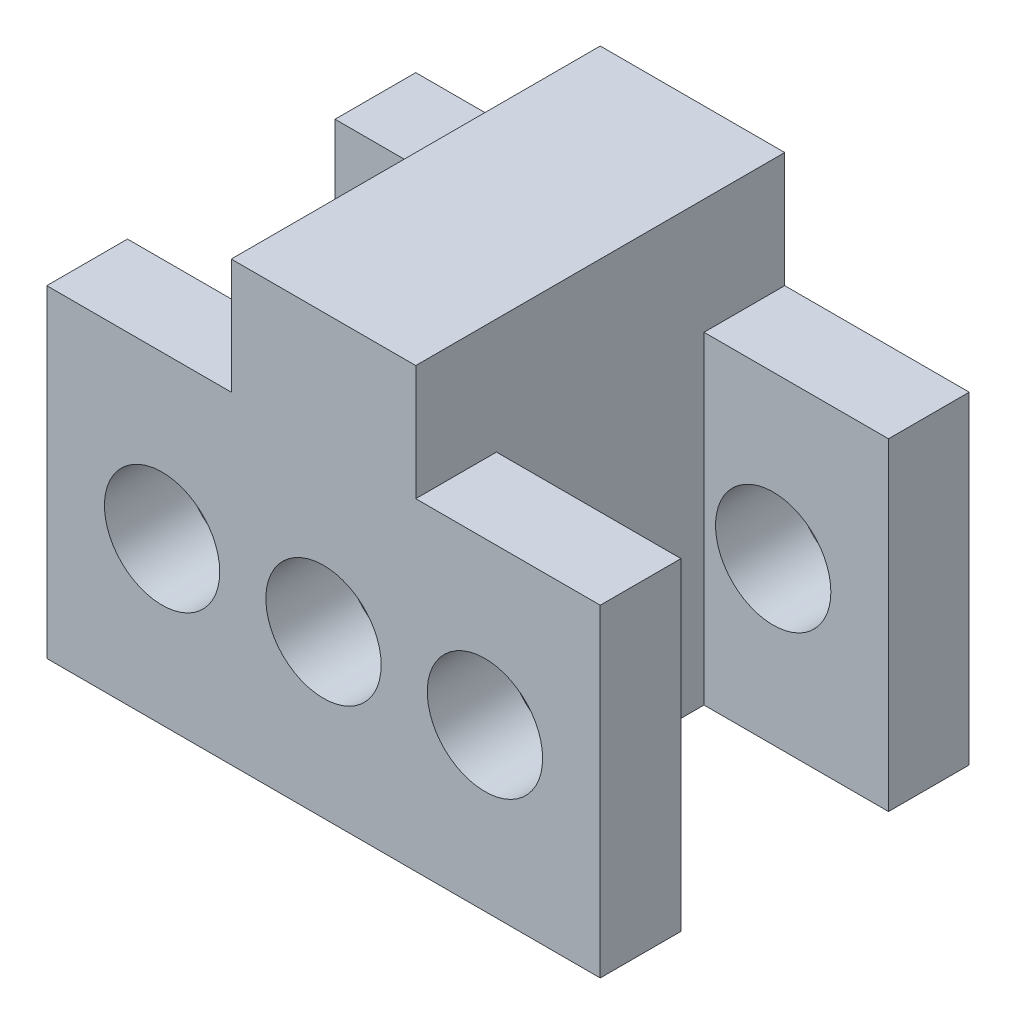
ISO-10303-21;
HEADER;
FILE_DESCRIPTION(('STEP AP214'),'2;1');
FILE_NAME('part.step','',(''),(''),'','','');
FILE_SCHEMA(('AUTOMOTIVE_DESIGN { 1 0 10303 214 1 1 1 1 }'));
ENDSEC;
DATA;
#1=APPLICATION_CONTEXT('core data for automotive mechanical design processes');
#2=APPLICATION_PROTOCOL_DEFINITION('international standard','automotive_design',2000,#1);
#3=PRODUCT_CONTEXT('',#1,'mechanical');
#4=PRODUCT('Part','Part','',(#3));
#5=PRODUCT_RELATED_PRODUCT_CATEGORY('part','',(#4));
#6=PRODUCT_DEFINITION_FORMATION('','',#4);
#7=PRODUCT_DEFINITION_CONTEXT('part definition',#1,'design');
#8=PRODUCT_DEFINITION('design','',#6,#7);
#9=PRODUCT_DEFINITION_SHAPE('','',#8);
#10=(LENGTH_UNIT() NAMED_UNIT(*) SI_UNIT(.MILLI.,.METRE.));
#11=(NAMED_UNIT(*) PLANE_ANGLE_UNIT() SI_UNIT($,.RADIAN.));
#12=(NAMED_UNIT(*) SI_UNIT($,.STERADIAN.) SOLID_ANGLE_UNIT());
#13=UNCERTAINTY_MEASURE_WITH_UNIT(LENGTH_MEASURE(1.E-05),#10,'distance_accuracy_value','');
#14=(GEOMETRIC_REPRESENTATION_CONTEXT(3) GLOBAL_UNCERTAINTY_ASSIGNED_CONTEXT((#13)) GLOBAL_UNIT_ASSIGNED_CONTEXT((#10,
#11,#12)) REPRESENTATION_CONTEXT('',''));
#15=CARTESIAN_POINT('',(0.,0.,0.));
#16=DIRECTION('',(0.,0.,1.));
#17=DIRECTION('',(1.,0.,0.));
#18=AXIS2_PLACEMENT_3D('',#15,#16,#17);
#19=CARTESIAN_POINT('',(-48.,-28.,18.));
#20=DIRECTION('',(0.,0.,1.));
#21=DIRECTION('',(1.,0.,0.));
#22=AXIS2_PLACEMENT_3D('',#19,#20,#21);
#23=PLANE('',#22);
#24=CARTESIAN_POINT('',(28.,0.,18.));
#25=DIRECTION('',(0.,0.,1.));
#26=DIRECTION('',(1.,0.,0.));
#27=AXIS2_PLACEMENT_3D('',#24,#25,#26);
#28=CIRCLE('',#27,10.);
#29=CARTESIAN_POINT('',(38.,0.,18.));
#30=VERTEX_POINT('',#29);
#31=EDGE_CURVE('E234',#30,#30,#28,.T.);
#32=ORIENTED_EDGE('',*,*,#31,.T.);
#33=EDGE_LOOP('',(#32));
#34=FACE_BOUND('',#33,.T.);
#35=DIRECTION('',(1.,0.,0.));
#36=VECTOR('',#35,1.);
#37=CARTESIAN_POINT('',(-48.,-28.,18.));
#38=LINE('',#37,#36);
#39=CARTESIAN_POINT('',(16.,-28.,18.));
#40=VERTEX_POINT('',#39);
#41=CARTESIAN_POINT('',(48.,-28.,18.));
#42=VERTEX_POINT('',#41);
#43=EDGE_CURVE('E49',#40,#42,#38,.T.);
#44=ORIENTED_EDGE('',*,*,#43,.F.);
#45=DIRECTION('',(0.,-1.,0.));
#46=VECTOR('',#45,1.);
#47=CARTESIAN_POINT('',(15.9999999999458,500000.,18.));
#48=LINE('',#47,#46);
#49=CARTESIAN_POINT('',(16.,28.,18.));
#50=VERTEX_POINT('',#49);
#51=EDGE_CURVE('E170',#50,#40,#48,.T.);
#52=ORIENTED_EDGE('',*,*,#51,.F.);
#53=DIRECTION('',(-1.,0.,0.));
#54=VECTOR('',#53,1.);
#55=CARTESIAN_POINT('',(-48.,28.,18.));
#56=LINE('',#55,#54);
#57=CARTESIAN_POINT('',(48.,28.,18.));
#58=VERTEX_POINT('',#57);
#59=EDGE_CURVE('E262',#58,#50,#56,.T.);
#60=ORIENTED_EDGE('',*,*,#59,.F.);
#61=DIRECTION('',(0.,1.,0.));
#62=VECTOR('',#61,1.);
#63=CARTESIAN_POINT('',(48.,28.,18.));
#64=LINE('',#63,#62);
#65=EDGE_CURVE('E258',#42,#58,#64,.T.);
#66=ORIENTED_EDGE('',*,*,#65,.F.);
#67=EDGE_LOOP('',(#44,#52,#60,#66));
#68=FACE_BOUND('',#67,.T.);
#69=ADVANCED_FACE('F31',(#34,#68),#23,.F.);
#70=CARTESIAN_POINT('',(-48.,-28.,-18.));
#71=DIRECTION('',(0.,0.,-1.));
#72=DIRECTION('',(1.,0.,0.));
#73=AXIS2_PLACEMENT_3D('',#70,#71,#72);
#74=PLANE('',#73);
#75=CARTESIAN_POINT('',(28.,0.,-18.));
#76=DIRECTION('',(0.,0.,1.));
#77=DIRECTION('',(1.,0.,0.));
#78=AXIS2_PLACEMENT_3D('',#75,#76,#77);
#79=CIRCLE('',#78,10.);
#80=CARTESIAN_POINT('',(38.,0.,-18.));
#81=VERTEX_POINT('',#80);
#82=EDGE_CURVE('E187',#81,#81,#79,.T.);
#83=ORIENTED_EDGE('',*,*,#82,.F.);
#84=EDGE_LOOP('',(#83));
#85=FACE_BOUND('',#84,.T.);
#86=DIRECTION('',(-1.,0.,0.));
#87=VECTOR('',#86,1.);
#88=CARTESIAN_POINT('',(-48.,28.,-18.));
#89=LINE('',#88,#87);
#90=CARTESIAN_POINT('',(48.,28.,-18.));
#91=VERTEX_POINT('',#90);
#92=CARTESIAN_POINT('',(16.,28.,-18.));
#93=VERTEX_POINT('',#92);
#94=EDGE_CURVE('E166',#91,#93,#89,.T.);
#95=ORIENTED_EDGE('',*,*,#94,.T.);
#96=DIRECTION('',(0.,-1.,0.));
#97=VECTOR('',#96,1.);
#98=CARTESIAN_POINT('',(15.9999999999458,500000.,-18.));
#99=LINE('',#98,#97);
#100=CARTESIAN_POINT('',(16.,-28.,-18.));
#101=VERTEX_POINT('',#100);
#102=EDGE_CURVE('E163',#93,#101,#99,.T.);
#103=ORIENTED_EDGE('',*,*,#102,.T.);
#104=DIRECTION('',(1.,0.,0.));
#105=VECTOR('',#104,1.);
#106=CARTESIAN_POINT('',(-48.,-28.,-18.));
#107=LINE('',#106,#105);
#108=CARTESIAN_POINT('',(48.,-28.,-18.));
#109=VERTEX_POINT('',#108);
#110=EDGE_CURVE('E148',#101,#109,#107,.T.);
#111=ORIENTED_EDGE('',*,*,#110,.T.);
#112=DIRECTION('',(0.,1.,0.));
#113=VECTOR('',#112,1.);
#114=CARTESIAN_POINT('',(48.,28.,-18.));
#115=LINE('',#114,#113);
#116=EDGE_CURVE('E159',#109,#91,#115,.T.);
#117=ORIENTED_EDGE('',*,*,#116,.T.);
#118=EDGE_LOOP('',(#95,#103,#111,#117));
#119=FACE_BOUND('',#118,.T.);
#120=ADVANCED_FACE('F164',(#85,#119),#74,.F.);
#121=CARTESIAN_POINT('',(16.,28.,32.));
#122=DIRECTION('',(-1.,0.,0.));
#123=DIRECTION('',(0.,-1.,0.));
#124=AXIS2_PLACEMENT_3D('',#121,#122,#123);
#125=PLANE('',#124);
#126=DIRECTION('',(0.,1.,0.));
#127=VECTOR('',#126,1.);
#128=CARTESIAN_POINT('',(16.,28.,-32.));
#129=LINE('',#128,#127);
#130=CARTESIAN_POINT('',(16.,28.,-32.));
#131=VERTEX_POINT('',#130);
#132=CARTESIAN_POINT('',(16.,48.,-32.));
#133=VERTEX_POINT('',#132);
#134=EDGE_CURVE('E291',#131,#133,#129,.T.);
#135=ORIENTED_EDGE('',*,*,#134,.T.);
#136=DIRECTION('',(0.,0.,-1.));
#137=VECTOR('',#136,1.);
#138=CARTESIAN_POINT('',(16.,48.,32.));
#139=LINE('',#138,#137);
#140=CARTESIAN_POINT('',(16.,48.,32.));
#141=VERTEX_POINT('',#140);
#142=EDGE_CURVE('E11',#141,#133,#139,.T.);
#143=ORIENTED_EDGE('',*,*,#142,.F.);
#144=DIRECTION('',(0.,1.,0.));
#145=VECTOR('',#144,1.);
#146=CARTESIAN_POINT('',(16.,28.,32.));
#147=LINE('',#146,#145);
#148=CARTESIAN_POINT('',(16.,28.,32.));
#149=VERTEX_POINT('',#148);
#150=EDGE_CURVE('E303',#149,#141,#147,.T.);
#151=ORIENTED_EDGE('',*,*,#150,.F.);
#152=DIRECTION('',(0.,0.,-1.));
#153=VECTOR('',#152,1.);
#154=CARTESIAN_POINT('',(16.,28.,32.));
#155=LINE('',#154,#153);
#156=EDGE_CURVE('E308',#149,#50,#155,.T.);
#157=ORIENTED_EDGE('',*,*,#156,.T.);
#158=ORIENTED_EDGE('',*,*,#51,.T.);
#159=DIRECTION('',(0.,0.,1.));
#160=VECTOR('',#159,1.);
#161=CARTESIAN_POINT('',(16.,-28.,18.));
#162=LINE('',#161,#160);
#163=EDGE_CURVE('E153',#101,#40,#162,.T.);
#164=ORIENTED_EDGE('',*,*,#163,.F.);
#165=ORIENTED_EDGE('',*,*,#102,.F.);
#166=DIRECTION('',(0.,0.,1.));
#167=VECTOR('',#166,1.);
#168=CARTESIAN_POINT('',(16.,28.,32.));
#169=LINE('',#168,#167);
#170=EDGE_CURVE('E231',#131,#93,#169,.T.);
#171=ORIENTED_EDGE('',*,*,#170,.F.);
#172=EDGE_LOOP('',(#135,#143,#151,#157,#158,#164,#165,#171));
#173=FACE_BOUND('',#172,.T.);
#174=ADVANCED_FACE('F33',(#173),#125,.F.);
#175=CARTESIAN_POINT('',(16.,48.,32.));
#176=DIRECTION('',(0.,-1.,0.));
#177=DIRECTION('',(0.,0.,-1.));
#178=AXIS2_PLACEMENT_3D('',#175,#176,#177);
#179=PLANE('',#178);
#180=DIRECTION('',(-1.,0.,0.));
#181=VECTOR('',#180,1.);
#182=CARTESIAN_POINT('',(16.,48.,-32.));
#183=LINE('',#182,#181);
#184=CARTESIAN_POINT('',(-16.,48.,-32.));
#185=VERTEX_POINT('',#184);
#186=EDGE_CURVE('E295',#133,#185,#183,.T.);
#187=ORIENTED_EDGE('',*,*,#186,.T.);
#188=DIRECTION('',(0.,0.,-1.));
#189=VECTOR('',#188,1.);
#190=CARTESIAN_POINT('',(-16.,48.,32.));
#191=LINE('',#190,#189);
#192=CARTESIAN_POINT('',(-16.,48.,32.));
#193=VERTEX_POINT('',#192);
#194=EDGE_CURVE('E41',#193,#185,#191,.T.);
#195=ORIENTED_EDGE('',*,*,#194,.F.);
#196=DIRECTION('',(-1.,0.,0.));
#197=VECTOR('',#196,1.);
#198=CARTESIAN_POINT('',(16.,48.,32.));
#199=LINE('',#198,#197);
#200=EDGE_CURVE('E300',#141,#193,#199,.T.);
#201=ORIENTED_EDGE('',*,*,#200,.F.);
#202=ORIENTED_EDGE('',*,*,#142,.T.);
#203=EDGE_LOOP('',(#187,#195,#201,#202));
#204=FACE_BOUND('',#203,.T.);
#205=ADVANCED_FACE('F326',(#204),#179,.F.);
#206=CARTESIAN_POINT('',(-16.,48.,32.));
#207=DIRECTION('',(1.,0.,0.));
#208=DIRECTION('',(0.,1.,0.));
#209=AXIS2_PLACEMENT_3D('',#206,#207,#208);
#210=PLANE('',#209);
#211=DIRECTION('',(0.,-1.,0.));
#212=VECTOR('',#211,1.);
#213=CARTESIAN_POINT('',(-16.,48.,-32.));
#214=LINE('',#213,#212);
#215=CARTESIAN_POINT('',(-16.,28.,-32.));
#216=VERTEX_POINT('',#215);
#217=EDGE_CURVE('E298',#185,#216,#214,.T.);
#218=ORIENTED_EDGE('',*,*,#217,.T.);
#219=DIRECTION('',(0.,0.,-1.));
#220=VECTOR('',#219,1.);
#221=CARTESIAN_POINT('',(-16.,28.,32.));
#222=LINE('',#221,#220);
#223=CARTESIAN_POINT('',(-16.,28.,-18.));
#224=VERTEX_POINT('',#223);
#225=EDGE_CURVE('E222',#224,#216,#222,.T.);
#226=ORIENTED_EDGE('',*,*,#225,.F.);
#227=DIRECTION('',(0.,-1.,0.));
#228=VECTOR('',#227,1.);
#229=CARTESIAN_POINT('',(-16.0000000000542,500000.,-18.));
#230=LINE('',#229,#228);
#231=CARTESIAN_POINT('',(-16.,-28.,-18.));
#232=VERTEX_POINT('',#231);
#233=EDGE_CURVE('E169',#224,#232,#230,.T.);
#234=ORIENTED_EDGE('',*,*,#233,.T.);
#235=DIRECTION('',(0.,0.,-1.));
#236=VECTOR('',#235,1.);
#237=CARTESIAN_POINT('',(-16.,-28.,18.));
#238=LINE('',#237,#236);
#239=CARTESIAN_POINT('',(-16.,-28.,18.));
#240=VERTEX_POINT('',#239);
#241=EDGE_CURVE('E174',#240,#232,#238,.T.);
#242=ORIENTED_EDGE('',*,*,#241,.F.);
#243=DIRECTION('',(0.,-1.,0.));
#244=VECTOR('',#243,1.);
#245=CARTESIAN_POINT('',(-16.0000000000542,500000.,18.));
#246=LINE('',#245,#244);
#247=CARTESIAN_POINT('',(-16.,28.,18.));
#248=VERTEX_POINT('',#247);
#249=EDGE_CURVE('E57',#248,#240,#246,.T.);
#250=ORIENTED_EDGE('',*,*,#249,.F.);
#251=DIRECTION('',(0.,0.,-1.));
#252=VECTOR('',#251,1.);
#253=CARTESIAN_POINT('',(-16.,28.,32.));
#254=LINE('',#253,#252);
#255=CARTESIAN_POINT('',(-16.,28.,32.));
#256=VERTEX_POINT('',#255);
#257=EDGE_CURVE('E35',#256,#248,#254,.T.);
#258=ORIENTED_EDGE('',*,*,#257,.F.);
#259=DIRECTION('',(0.,-1.,0.));
#260=VECTOR('',#259,1.);
#261=CARTESIAN_POINT('',(-16.,48.,32.));
#262=LINE('',#261,#260);
#263=EDGE_CURVE('E310',#193,#256,#262,.T.);
#264=ORIENTED_EDGE('',*,*,#263,.F.);
#265=ORIENTED_EDGE('',*,*,#194,.T.);
#266=EDGE_LOOP('',(#218,#226,#234,#242,#250,#258,#264,#265));
#267=FACE_BOUND('',#266,.T.);
#268=ADVANCED_FACE('F329',(#267),#210,.F.);
#269=CARTESIAN_POINT('',(16.,48.,32.));
#270=DIRECTION('',(0.,0.,1.));
#271=DIRECTION('',(1.,0.,0.));
#272=AXIS2_PLACEMENT_3D('',#269,#270,#271);
#273=PLANE('',#272);
#274=ORIENTED_EDGE('',*,*,#150,.T.);
#275=ORIENTED_EDGE('',*,*,#200,.T.);
#276=ORIENTED_EDGE('',*,*,#263,.T.);
#277=DIRECTION('',(-1.,0.,0.));
#278=VECTOR('',#277,1.);
#279=CARTESIAN_POINT('',(-48.,28.,32.));
#280=LINE('',#279,#278);
#281=CARTESIAN_POINT('',(-48.,28.,32.));
#282=VERTEX_POINT('',#281);
#283=EDGE_CURVE('E274',#256,#282,#280,.T.);
#284=ORIENTED_EDGE('',*,*,#283,.T.);
#285=DIRECTION('',(0.,-1.,0.));
#286=VECTOR('',#285,1.);
#287=CARTESIAN_POINT('',(-48.,28.,32.));
#288=LINE('',#287,#286);
#289=CARTESIAN_POINT('',(-48.,-28.,32.));
#290=VERTEX_POINT('',#289);
#291=EDGE_CURVE('E249',#282,#290,#288,.T.);
#292=ORIENTED_EDGE('',*,*,#291,.T.);
#293=DIRECTION('',(1.,0.,0.));
#294=VECTOR('',#293,1.);
#295=CARTESIAN_POINT('',(-48.,-28.,32.));
#296=LINE('',#295,#294);
#297=CARTESIAN_POINT('',(48.,-28.,32.));
#298=VERTEX_POINT('',#297);
#299=EDGE_CURVE('E268',#290,#298,#296,.T.);
#300=ORIENTED_EDGE('',*,*,#299,.T.);
#301=DIRECTION('',(0.,1.,0.));
#302=VECTOR('',#301,1.);
#303=CARTESIAN_POINT('',(48.,28.,32.));
#304=LINE('',#303,#302);
#305=CARTESIAN_POINT('',(48.,28.,32.));
#306=VERTEX_POINT('',#305);
#307=EDGE_CURVE('E271',#298,#306,#304,.T.);
#308=ORIENTED_EDGE('',*,*,#307,.T.);
#309=EDGE_CURVE('E255',#306,#149,#280,.T.);
#310=ORIENTED_EDGE('',*,*,#309,.T.);
#311=EDGE_LOOP('',(#274,#275,#276,#284,#292,#300,#308,#310));
#312=FACE_BOUND('',#311,.T.);
#313=CARTESIAN_POINT('',(28.,0.,32.));
#314=DIRECTION('',(0.,0.,1.));
#315=DIRECTION('',(1.,0.,0.));
#316=AXIS2_PLACEMENT_3D('',#313,#314,#315);
#317=CIRCLE('',#316,10.);
#318=CARTESIAN_POINT('',(38.,0.,32.));
#319=VERTEX_POINT('',#318);
#320=EDGE_CURVE('E233',#319,#319,#317,.T.);
#321=ORIENTED_EDGE('',*,*,#320,.F.);
#322=EDGE_LOOP('',(#321));
#323=FACE_BOUND('',#322,.T.);
#324=CARTESIAN_POINT('',(-28.,0.,32.));
#325=DIRECTION('',(0.,0.,1.));
#326=DIRECTION('',(1.,0.,0.));
#327=AXIS2_PLACEMENT_3D('',#324,#325,#326);
#328=CIRCLE('',#327,10.);
#329=CARTESIAN_POINT('',(-18.,0.,32.));
#330=VERTEX_POINT('',#329);
#331=EDGE_CURVE('E237',#330,#330,#328,.T.);
#332=ORIENTED_EDGE('',*,*,#331,.F.);
#333=EDGE_LOOP('',(#332));
#334=FACE_BOUND('',#333,.T.);
#335=CARTESIAN_POINT('',(0.,0.,32.));
#336=DIRECTION('',(0.,0.,1.));
#337=DIRECTION('',(1.,0.,0.));
#338=AXIS2_PLACEMENT_3D('',#335,#336,#337);
#339=CIRCLE('',#338,10.);
#340=CARTESIAN_POINT('',(10.,0.,32.));
#341=VERTEX_POINT('',#340);
#342=EDGE_CURVE('E243',#341,#341,#339,.T.);
#343=ORIENTED_EDGE('',*,*,#342,.F.);
#344=EDGE_LOOP('',(#343));
#345=FACE_BOUND('',#344,.T.);
#346=ADVANCED_FACE('F321',(#312,#323,#334,#345),#273,.T.);
#347=CARTESIAN_POINT('',(16.,48.,-32.));
#348=DIRECTION('',(0.,0.,1.));
#349=DIRECTION('',(1.,0.,0.));
#350=AXIS2_PLACEMENT_3D('',#347,#348,#349);
#351=PLANE('',#350);
#352=ORIENTED_EDGE('',*,*,#134,.F.);
#353=DIRECTION('',(-1.,0.,0.));
#354=VECTOR('',#353,1.);
#355=CARTESIAN_POINT('',(-48.,28.,-32.));
#356=LINE('',#355,#354);
#357=CARTESIAN_POINT('',(48.,28.,-32.));
#358=VERTEX_POINT('',#357);
#359=EDGE_CURVE('E213',#358,#131,#356,.T.);
#360=ORIENTED_EDGE('',*,*,#359,.F.);
#361=DIRECTION('',(0.,1.,0.));
#362=VECTOR('',#361,1.);
#363=CARTESIAN_POINT('',(48.,28.,-32.));
#364=LINE('',#363,#362);
#365=CARTESIAN_POINT('',(48.,-28.,-32.));
#366=VERTEX_POINT('',#365);
#367=EDGE_CURVE('E216',#366,#358,#364,.T.);
#368=ORIENTED_EDGE('',*,*,#367,.F.);
#369=DIRECTION('',(1.,0.,0.));
#370=VECTOR('',#369,1.);
#371=CARTESIAN_POINT('',(-48.,-28.,-32.));
#372=LINE('',#371,#370);
#373=CARTESIAN_POINT('',(-48.,-28.,-32.));
#374=VERTEX_POINT('',#373);
#375=EDGE_CURVE('E206',#374,#366,#372,.T.);
#376=ORIENTED_EDGE('',*,*,#375,.F.);
#377=DIRECTION('',(0.,-1.,0.));
#378=VECTOR('',#377,1.);
#379=CARTESIAN_POINT('',(-48.,28.,-32.));
#380=LINE('',#379,#378);
#381=CARTESIAN_POINT('',(-48.,28.,-32.));
#382=VERTEX_POINT('',#381);
#383=EDGE_CURVE('E201',#382,#374,#380,.T.);
#384=ORIENTED_EDGE('',*,*,#383,.F.);
#385=EDGE_CURVE('E212',#216,#382,#356,.T.);
#386=ORIENTED_EDGE('',*,*,#385,.F.);
#387=ORIENTED_EDGE('',*,*,#217,.F.);
#388=ORIENTED_EDGE('',*,*,#186,.F.);
#389=EDGE_LOOP('',(#352,#360,#368,#376,#384,#386,#387,#388));
#390=FACE_BOUND('',#389,.T.);
#391=CARTESIAN_POINT('',(-28.,0.,-32.));
#392=DIRECTION('',(0.,0.,1.));
#393=DIRECTION('',(1.,0.,0.));
#394=AXIS2_PLACEMENT_3D('',#391,#392,#393);
#395=CIRCLE('',#394,10.);
#396=CARTESIAN_POINT('',(-18.,0.,-32.));
#397=VERTEX_POINT('',#396);
#398=EDGE_CURVE('E190',#397,#397,#395,.T.);
#399=ORIENTED_EDGE('',*,*,#398,.T.);
#400=EDGE_LOOP('',(#399));
#401=FACE_BOUND('',#400,.T.);
#402=CARTESIAN_POINT('',(0.,0.,-32.));
#403=DIRECTION('',(0.,0.,1.));
#404=DIRECTION('',(1.,0.,0.));
#405=AXIS2_PLACEMENT_3D('',#402,#403,#404);
#406=CIRCLE('',#405,10.);
#407=CARTESIAN_POINT('',(10.,0.,-32.));
#408=VERTEX_POINT('',#407);
#409=EDGE_CURVE('E196',#408,#408,#406,.T.);
#410=ORIENTED_EDGE('',*,*,#409,.T.);
#411=EDGE_LOOP('',(#410));
#412=FACE_BOUND('',#411,.T.);
#413=CARTESIAN_POINT('',(28.,0.,-32.));
#414=DIRECTION('',(0.,0.,1.));
#415=DIRECTION('',(1.,0.,0.));
#416=AXIS2_PLACEMENT_3D('',#413,#414,#415);
#417=CIRCLE('',#416,10.);
#418=CARTESIAN_POINT('',(38.,0.,-32.));
#419=VERTEX_POINT('',#418);
#420=EDGE_CURVE('E186',#419,#419,#417,.T.);
#421=ORIENTED_EDGE('',*,*,#420,.T.);
#422=EDGE_LOOP('',(#421));
#423=FACE_BOUND('',#422,.T.);
#424=ADVANCED_FACE('F376',(#390,#401,#412,#423),#351,.F.);
#425=CARTESIAN_POINT('',(-48.,28.,18.));
#426=DIRECTION('',(0.,1.,0.));
#427=DIRECTION('',(-1.,0.,0.));
#428=AXIS2_PLACEMENT_3D('',#425,#426,#427);
#429=PLANE('',#428);
#430=ORIENTED_EDGE('',*,*,#156,.F.);
#431=ORIENTED_EDGE('',*,*,#309,.F.);
#432=DIRECTION('',(0.,0.,1.));
#433=VECTOR('',#432,1.);
#434=CARTESIAN_POINT('',(48.,28.,18.));
#435=LINE('',#434,#433);
#436=EDGE_CURVE('E287',#58,#306,#435,.T.);
#437=ORIENTED_EDGE('',*,*,#436,.F.);
#438=ORIENTED_EDGE('',*,*,#59,.T.);
#439=EDGE_LOOP('',(#430,#431,#437,#438));
#440=FACE_BOUND('',#439,.T.);
#441=ADVANCED_FACE('F340',(#440),#429,.T.);
#442=CARTESIAN_POINT('',(-48.,28.,18.));
#443=DIRECTION('',(-1.,0.,0.));
#444=DIRECTION('',(0.,-1.,0.));
#445=AXIS2_PLACEMENT_3D('',#442,#443,#444);
#446=PLANE('',#445);
#447=ORIENTED_EDGE('',*,*,#291,.F.);
#448=DIRECTION('',(0.,0.,1.));
#449=VECTOR('',#448,1.);
#450=CARTESIAN_POINT('',(-48.,28.,18.));
#451=LINE('',#450,#449);
#452=CARTESIAN_POINT('',(-48.,28.,18.));
#453=VERTEX_POINT('',#452);
#454=EDGE_CURVE('E277',#453,#282,#451,.T.);
#455=ORIENTED_EDGE('',*,*,#454,.F.);
#456=DIRECTION('',(0.,-1.,0.));
#457=VECTOR('',#456,1.);
#458=CARTESIAN_POINT('',(-48.,28.,18.));
#459=LINE('',#458,#457);
#460=CARTESIAN_POINT('',(-48.,-28.,18.));
#461=VERTEX_POINT('',#460);
#462=EDGE_CURVE('E252',#453,#461,#459,.T.);
#463=ORIENTED_EDGE('',*,*,#462,.T.);
#464=DIRECTION('',(0.,0.,1.));
#465=VECTOR('',#464,1.);
#466=CARTESIAN_POINT('',(-48.,-28.,18.));
#467=LINE('',#466,#465);
#468=EDGE_CURVE('E265',#461,#290,#467,.T.);
#469=ORIENTED_EDGE('',*,*,#468,.T.);
#470=EDGE_LOOP('',(#447,#455,#463,#469));
#471=FACE_BOUND('',#470,.T.);
#472=ADVANCED_FACE('F334',(#471),#446,.T.);
#473=ORIENTED_EDGE('',*,*,#283,.F.);
#474=ORIENTED_EDGE('',*,*,#257,.T.);
#475=EDGE_CURVE('E261',#248,#453,#56,.T.);
#476=ORIENTED_EDGE('',*,*,#475,.T.);
#477=ORIENTED_EDGE('',*,*,#454,.T.);
#478=EDGE_LOOP('',(#473,#474,#476,#477));
#479=FACE_BOUND('',#478,.T.);
#480=ADVANCED_FACE('F332',(#479),#429,.T.);
#481=CARTESIAN_POINT('',(48.,28.,18.));
#482=DIRECTION('',(1.,0.,0.));
#483=DIRECTION('',(0.,1.,0.));
#484=AXIS2_PLACEMENT_3D('',#481,#482,#483);
#485=PLANE('',#484);
#486=ORIENTED_EDGE('',*,*,#307,.F.);
#487=DIRECTION('',(0.,0.,1.));
#488=VECTOR('',#487,1.);
#489=CARTESIAN_POINT('',(48.,-28.,18.));
#490=LINE('',#489,#488);
#491=EDGE_CURVE('E286',#42,#298,#490,.T.);
#492=ORIENTED_EDGE('',*,*,#491,.F.);
#493=ORIENTED_EDGE('',*,*,#65,.T.);
#494=ORIENTED_EDGE('',*,*,#436,.T.);
#495=EDGE_LOOP('',(#486,#492,#493,#494));
#496=FACE_BOUND('',#495,.T.);
#497=ADVANCED_FACE('F337',(#496),#485,.T.);
#498=CARTESIAN_POINT('',(-48.,-28.,18.));
#499=DIRECTION('',(0.,-1.,0.));
#500=DIRECTION('',(1.,0.,0.));
#501=AXIS2_PLACEMENT_3D('',#498,#499,#500);
#502=PLANE('',#501);
#503=ORIENTED_EDGE('',*,*,#299,.F.);
#504=ORIENTED_EDGE('',*,*,#468,.F.);
#505=EDGE_CURVE('E256',#461,#240,#38,.T.);
#506=ORIENTED_EDGE('',*,*,#505,.T.);
#507=ORIENTED_EDGE('',*,*,#241,.T.);
#508=CARTESIAN_POINT('',(-48.,-28.,-18.));
#509=VERTEX_POINT('',#508);
#510=EDGE_CURVE('E158',#509,#232,#107,.T.);
#511=ORIENTED_EDGE('',*,*,#510,.F.);
#512=DIRECTION('',(0.,0.,-1.));
#513=VECTOR('',#512,1.);
#514=CARTESIAN_POINT('',(-48.,-28.,-18.));
#515=LINE('',#514,#513);
#516=EDGE_CURVE('E219',#509,#374,#515,.T.);
#517=ORIENTED_EDGE('',*,*,#516,.T.);
#518=ORIENTED_EDGE('',*,*,#375,.T.);
#519=DIRECTION('',(0.,0.,-1.));
#520=VECTOR('',#519,1.);
#521=CARTESIAN_POINT('',(48.,-28.,-18.));
#522=LINE('',#521,#520);
#523=EDGE_CURVE('E155',#109,#366,#522,.T.);
#524=ORIENTED_EDGE('',*,*,#523,.F.);
#525=ORIENTED_EDGE('',*,*,#110,.F.);
#526=ORIENTED_EDGE('',*,*,#163,.T.);
#527=ORIENTED_EDGE('',*,*,#43,.T.);
#528=ORIENTED_EDGE('',*,*,#491,.T.);
#529=EDGE_LOOP('',(#503,#504,#506,#507,#511,#517,#518,#524,#525,#526,#527,#528));
#530=FACE_BOUND('',#529,.T.);
#531=ADVANCED_FACE('F151',(#530),#502,.T.);
#532=CARTESIAN_POINT('',(-28.,0.,18.));
#533=DIRECTION('',(0.,0.,1.));
#534=DIRECTION('',(1.,0.,0.));
#535=AXIS2_PLACEMENT_3D('',#532,#533,#534);
#536=CIRCLE('',#535,10.);
#537=CARTESIAN_POINT('',(-18.,0.,18.));
#538=VERTEX_POINT('',#537);
#539=EDGE_CURVE('E240',#538,#538,#536,.T.);
#540=ORIENTED_EDGE('',*,*,#539,.T.);
#541=EDGE_LOOP('',(#540));
#542=FACE_BOUND('',#541,.T.);
#543=ORIENTED_EDGE('',*,*,#475,.F.);
#544=ORIENTED_EDGE('',*,*,#249,.T.);
#545=ORIENTED_EDGE('',*,*,#505,.F.);
#546=ORIENTED_EDGE('',*,*,#462,.F.);
#547=EDGE_LOOP('',(#543,#544,#545,#546));
#548=FACE_BOUND('',#547,.T.);
#549=ADVANCED_FACE('F345',(#542,#548),#23,.F.);
#550=CARTESIAN_POINT('',(0.,0.,18.));
#551=DIRECTION('',(0.,0.,1.));
#552=DIRECTION('',(1.,0.,0.));
#553=AXIS2_PLACEMENT_3D('',#550,#551,#552);
#554=CYLINDRICAL_SURFACE('',#553,10.);
#555=CARTESIAN_POINT('',(0.,0.,18.));
#556=DIRECTION('',(0.,0.,1.));
#557=DIRECTION('',(1.,0.,0.));
#558=AXIS2_PLACEMENT_3D('',#555,#556,#557);
#559=CIRCLE('',#558,10.);
#560=CARTESIAN_POINT('',(10.,0.,18.));
#561=VERTEX_POINT('',#560);
#562=EDGE_CURVE('E246',#561,#561,#559,.T.);
#563=ORIENTED_EDGE('',*,*,#562,.F.);
#564=EDGE_LOOP('',(#563));
#565=FACE_BOUND('',#564,.T.);
#566=ORIENTED_EDGE('',*,*,#342,.T.);
#567=EDGE_LOOP('',(#566));
#568=FACE_BOUND('',#567,.T.);
#569=ADVANCED_FACE('F355',(#565,#568),#554,.F.);
#570=CARTESIAN_POINT('',(-28.,0.,18.));
#571=DIRECTION('',(0.,0.,1.));
#572=DIRECTION('',(1.,0.,0.));
#573=AXIS2_PLACEMENT_3D('',#570,#571,#572);
#574=CYLINDRICAL_SURFACE('',#573,10.);
#575=ORIENTED_EDGE('',*,*,#539,.F.);
#576=EDGE_LOOP('',(#575));
#577=FACE_BOUND('',#576,.T.);
#578=ORIENTED_EDGE('',*,*,#331,.T.);
#579=EDGE_LOOP('',(#578));
#580=FACE_BOUND('',#579,.T.);
#581=ADVANCED_FACE('F361',(#577,#580),#574,.F.);
#582=CARTESIAN_POINT('',(28.,0.,18.));
#583=DIRECTION('',(0.,0.,1.));
#584=DIRECTION('',(1.,0.,0.));
#585=AXIS2_PLACEMENT_3D('',#582,#583,#584);
#586=CYLINDRICAL_SURFACE('',#585,10.);
#587=ORIENTED_EDGE('',*,*,#31,.F.);
#588=EDGE_LOOP('',(#587));
#589=FACE_BOUND('',#588,.T.);
#590=ORIENTED_EDGE('',*,*,#320,.T.);
#591=EDGE_LOOP('',(#590));
#592=FACE_BOUND('',#591,.T.);
#593=ADVANCED_FACE('F387',(#589,#592),#586,.F.);
#594=CARTESIAN_POINT('',(-48.,28.,-18.));
#595=DIRECTION('',(0.,-1.,0.));
#596=DIRECTION('',(1.,0.,0.));
#597=AXIS2_PLACEMENT_3D('',#594,#595,#596);
#598=PLANE('',#597);
#599=ORIENTED_EDGE('',*,*,#359,.T.);
#600=ORIENTED_EDGE('',*,*,#170,.T.);
#601=ORIENTED_EDGE('',*,*,#94,.F.);
#602=DIRECTION('',(0.,0.,-1.));
#603=VECTOR('',#602,1.);
#604=CARTESIAN_POINT('',(48.,28.,-18.));
#605=LINE('',#604,#603);
#606=EDGE_CURVE('E224',#91,#358,#605,.T.);
#607=ORIENTED_EDGE('',*,*,#606,.T.);
#608=EDGE_LOOP('',(#599,#600,#601,#607));
#609=FACE_BOUND('',#608,.T.);
#610=ADVANCED_FACE('F384',(#609),#598,.F.);
#611=CARTESIAN_POINT('',(-48.,28.,-18.));
#612=VERTEX_POINT('',#611);
#613=EDGE_CURVE('E205',#224,#612,#89,.T.);
#614=ORIENTED_EDGE('',*,*,#613,.F.);
#615=ORIENTED_EDGE('',*,*,#225,.T.);
#616=ORIENTED_EDGE('',*,*,#385,.T.);
#617=DIRECTION('',(0.,0.,-1.));
#618=VECTOR('',#617,1.);
#619=CARTESIAN_POINT('',(-48.,28.,-18.));
#620=LINE('',#619,#618);
#621=EDGE_CURVE('E209',#612,#382,#620,.T.);
#622=ORIENTED_EDGE('',*,*,#621,.F.);
#623=EDGE_LOOP('',(#614,#615,#616,#622));
#624=FACE_BOUND('',#623,.T.);
#625=ADVANCED_FACE('F386',(#624),#598,.F.);
#626=CARTESIAN_POINT('',(-28.,0.,-18.));
#627=DIRECTION('',(0.,0.,1.));
#628=DIRECTION('',(1.,0.,0.));
#629=AXIS2_PLACEMENT_3D('',#626,#627,#628);
#630=CIRCLE('',#629,10.);
#631=CARTESIAN_POINT('',(-18.,0.,-18.));
#632=VERTEX_POINT('',#631);
#633=EDGE_CURVE('E193',#632,#632,#630,.T.);
#634=ORIENTED_EDGE('',*,*,#633,.F.);
#635=EDGE_LOOP('',(#634));
#636=FACE_BOUND('',#635,.T.);
#637=ORIENTED_EDGE('',*,*,#510,.T.);
#638=ORIENTED_EDGE('',*,*,#233,.F.);
#639=ORIENTED_EDGE('',*,*,#613,.T.);
#640=DIRECTION('',(0.,-1.,0.));
#641=VECTOR('',#640,1.);
#642=CARTESIAN_POINT('',(-48.,28.,-18.));
#643=LINE('',#642,#641);
#644=EDGE_CURVE('E202',#612,#509,#643,.T.);
#645=ORIENTED_EDGE('',*,*,#644,.T.);
#646=EDGE_LOOP('',(#637,#638,#639,#645));
#647=FACE_BOUND('',#646,.T.);
#648=ADVANCED_FACE('F351',(#636,#647),#74,.F.);
#649=CARTESIAN_POINT('',(-48.,28.,-18.));
#650=DIRECTION('',(1.,0.,0.));
#651=DIRECTION('',(0.,1.,0.));
#652=AXIS2_PLACEMENT_3D('',#649,#650,#651);
#653=PLANE('',#652);
#654=ORIENTED_EDGE('',*,*,#383,.T.);
#655=ORIENTED_EDGE('',*,*,#516,.F.);
#656=ORIENTED_EDGE('',*,*,#644,.F.);
#657=ORIENTED_EDGE('',*,*,#621,.T.);
#658=EDGE_LOOP('',(#654,#655,#656,#657));
#659=FACE_BOUND('',#658,.T.);
#660=ADVANCED_FACE('F373',(#659),#653,.F.);
#661=CARTESIAN_POINT('',(48.,28.,-18.));
#662=DIRECTION('',(-1.,0.,0.));
#663=DIRECTION('',(0.,-1.,0.));
#664=AXIS2_PLACEMENT_3D('',#661,#662,#663);
#665=PLANE('',#664);
#666=ORIENTED_EDGE('',*,*,#367,.T.);
#667=ORIENTED_EDGE('',*,*,#606,.F.);
#668=ORIENTED_EDGE('',*,*,#116,.F.);
#669=ORIENTED_EDGE('',*,*,#523,.T.);
#670=EDGE_LOOP('',(#666,#667,#668,#669));
#671=FACE_BOUND('',#670,.T.);
#672=ADVANCED_FACE('F382',(#671),#665,.F.);
#673=CARTESIAN_POINT('',(0.,0.,-18.));
#674=DIRECTION('',(0.,0.,-1.));
#675=DIRECTION('',(-1.,0.,0.));
#676=AXIS2_PLACEMENT_3D('',#673,#674,#675);
#677=CYLINDRICAL_SURFACE('',#676,10.);
#678=CARTESIAN_POINT('',(0.,0.,-18.));
#679=DIRECTION('',(0.,0.,-1.));
#680=DIRECTION('',(-1.,0.,0.));
#681=AXIS2_PLACEMENT_3D('',#678,#679,#680);
#682=CIRCLE('',#681,10.);
#683=CARTESIAN_POINT('',(-10.,0.,-18.));
#684=VERTEX_POINT('',#683);
#685=EDGE_CURVE('E181',#684,#684,#682,.T.);
#686=ORIENTED_EDGE('',*,*,#685,.F.);
#687=EDGE_LOOP('',(#686));
#688=FACE_BOUND('',#687,.T.);
#689=ORIENTED_EDGE('',*,*,#409,.F.);
#690=EDGE_LOOP('',(#689));
#691=FACE_BOUND('',#690,.T.);
#692=ADVANCED_FACE('F457',(#688,#691),#677,.F.);
#693=CARTESIAN_POINT('',(-28.,0.,-18.));
#694=DIRECTION('',(0.,0.,-1.));
#695=DIRECTION('',(-1.,0.,0.));
#696=AXIS2_PLACEMENT_3D('',#693,#694,#695);
#697=CYLINDRICAL_SURFACE('',#696,10.);
#698=ORIENTED_EDGE('',*,*,#633,.T.);
#699=EDGE_LOOP('',(#698));
#700=FACE_BOUND('',#699,.T.);
#701=ORIENTED_EDGE('',*,*,#398,.F.);
#702=EDGE_LOOP('',(#701));
#703=FACE_BOUND('',#702,.T.);
#704=ADVANCED_FACE('F446',(#700,#703),#697,.F.);
#705=CARTESIAN_POINT('',(28.,0.,-18.));
#706=DIRECTION('',(0.,0.,-1.));
#707=DIRECTION('',(-1.,0.,0.));
#708=AXIS2_PLACEMENT_3D('',#705,#706,#707);
#709=CYLINDRICAL_SURFACE('',#708,10.);
#710=ORIENTED_EDGE('',*,*,#82,.T.);
#711=EDGE_LOOP('',(#710));
#712=FACE_BOUND('',#711,.T.);
#713=ORIENTED_EDGE('',*,*,#420,.F.);
#714=EDGE_LOOP('',(#713));
#715=FACE_BOUND('',#714,.T.);
#716=ADVANCED_FACE('F441',(#712,#715),#709,.F.);
#717=CARTESIAN_POINT('',(-16.0000000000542,500000.,-18.));
#718=DIRECTION('',(0.,0.,-1.));
#719=DIRECTION('',(-1.,0.,0.));
#720=AXIS2_PLACEMENT_3D('',#717,#718,#719);
#721=PLANE('',#720);
#722=ORIENTED_EDGE('',*,*,#685,.T.);
#723=EDGE_LOOP('',(#722));
#724=FACE_BOUND('',#723,.T.);
#725=ADVANCED_FACE('F445',(#724),#721,.T.);
#726=CARTESIAN_POINT('',(-16.0000000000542,500000.,18.));
#727=DIRECTION('',(0.,0.,1.));
#728=DIRECTION('',(1.,0.,0.));
#729=AXIS2_PLACEMENT_3D('',#726,#727,#728);
#730=PLANE('',#729);
#731=ORIENTED_EDGE('',*,*,#562,.T.);
#732=EDGE_LOOP('',(#731));
#733=FACE_BOUND('',#732,.T.);
#734=ADVANCED_FACE('F570',(#733),#730,.T.);
#735=CLOSED_SHELL('',(#69,#120,#174,#205,#268,#346,#424,#441,#472,#480,#497,#531,#549,#569,#581,
#593,#610,#625,#648,#660,#672,#692,#704,#716,#725,#734));
#736=MANIFOLD_SOLID_BREP('B2',#735);
#737=ADVANCED_BREP_SHAPE_REPRESENTATION('',(#18,#736),#14);
#738=SHAPE_DEFINITION_REPRESENTATION(#9,#737);
ENDSEC;
END-ISO-10303-21;
